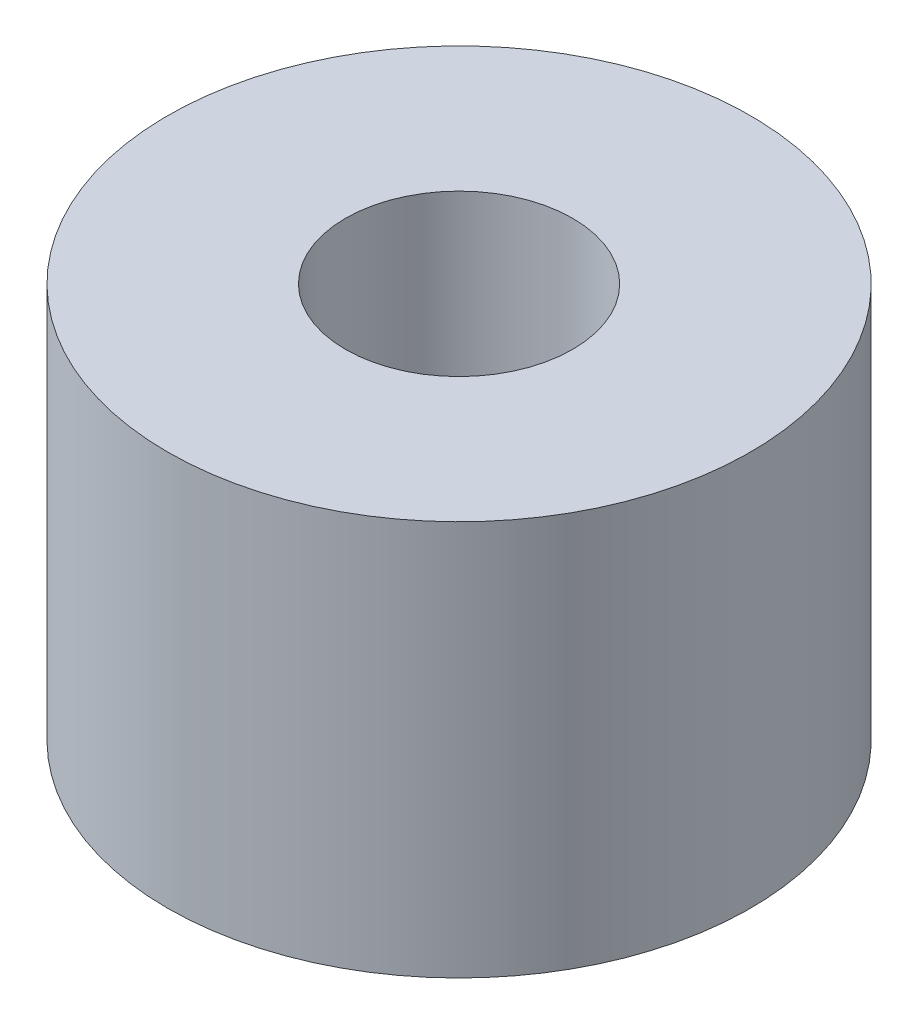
from build123d import *

# Parameters (mm, degrees)
SKETCH1_R           = 2.95
SKETCH1_R_2         = 1.15
BOSS_EXTRUDE1_DEPTH = 4


with BuildPart() as part:
    # Sketch1 → Boss-Extrude1 (new body)
    with BuildSketch(Plane(origin=(0, 0, 0), x_dir=(1, 0, 0), z_dir=(0, 1, 0))):
        with Locations(Location((0, 0, 0), (0, 0, 270))):
            Circle(SKETCH1_R)
        with Locations(Location((0, 0, 0), (0, 0, 270))):
            Circle(SKETCH1_R_2, mode=Mode.SUBTRACT)
    extrude(amount=BOSS_EXTRUDE1_DEPTH)


solid = part.part
